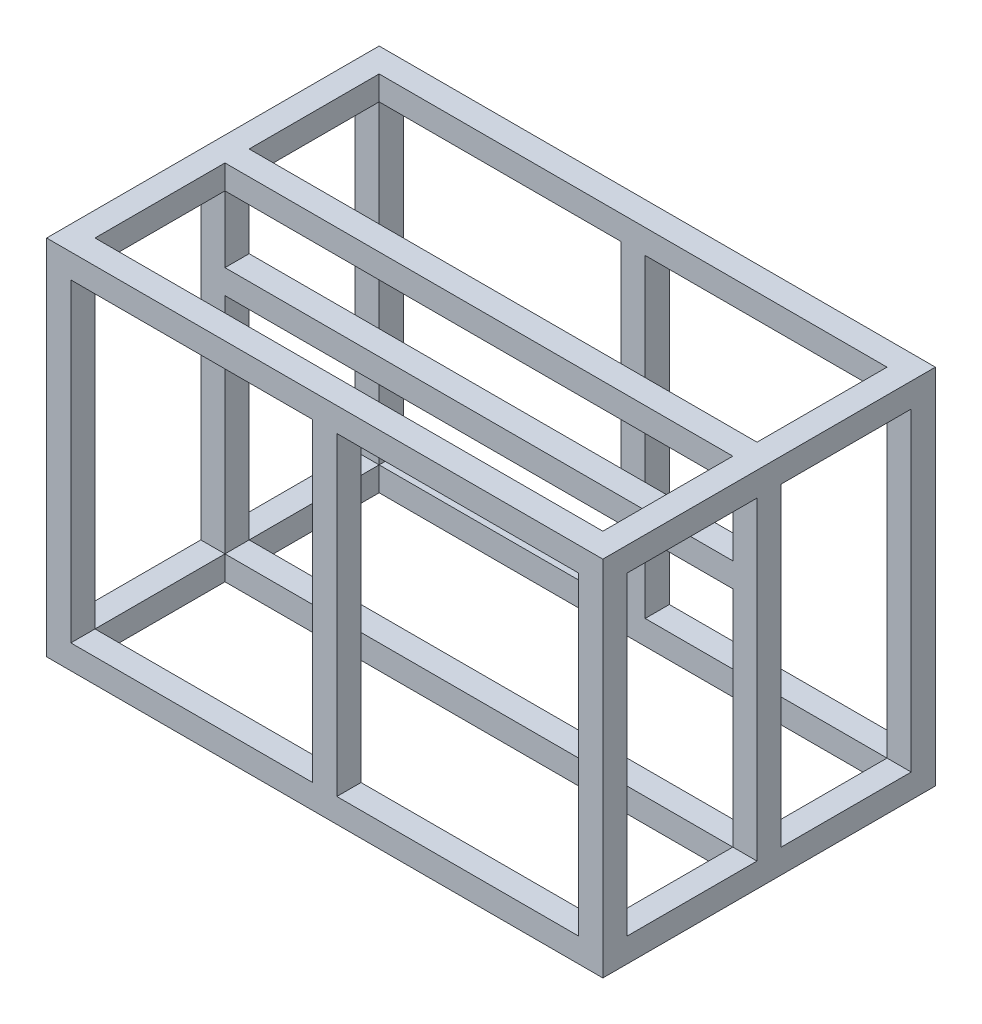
ISO-10303-21;
HEADER;
FILE_DESCRIPTION(('STEP AP214'),'2;1');
FILE_NAME('part.step','',(''),(''),'','','');
FILE_SCHEMA(('AUTOMOTIVE_DESIGN { 1 0 10303 214 1 1 1 1 }'));
ENDSEC;
DATA;
#1=APPLICATION_CONTEXT('core data for automotive mechanical design processes');
#2=APPLICATION_PROTOCOL_DEFINITION('international standard','automotive_design',2000,#1);
#3=PRODUCT_CONTEXT('',#1,'mechanical');
#4=PRODUCT('Part','Part','',(#3));
#5=PRODUCT_RELATED_PRODUCT_CATEGORY('part','',(#4));
#6=PRODUCT_DEFINITION_FORMATION('','',#4);
#7=PRODUCT_DEFINITION_CONTEXT('part definition',#1,'design');
#8=PRODUCT_DEFINITION('design','',#6,#7);
#9=PRODUCT_DEFINITION_SHAPE('','',#8);
#10=(LENGTH_UNIT() NAMED_UNIT(*) SI_UNIT(.MILLI.,.METRE.));
#11=(NAMED_UNIT(*) PLANE_ANGLE_UNIT() SI_UNIT($,.RADIAN.));
#12=(NAMED_UNIT(*) SI_UNIT($,.STERADIAN.) SOLID_ANGLE_UNIT());
#13=UNCERTAINTY_MEASURE_WITH_UNIT(LENGTH_MEASURE(1.E-05),#10,'distance_accuracy_value','');
#14=(GEOMETRIC_REPRESENTATION_CONTEXT(3) GLOBAL_UNCERTAINTY_ASSIGNED_CONTEXT((#13)) GLOBAL_UNIT_ASSIGNED_CONTEXT((#10,
#11,#12)) REPRESENTATION_CONTEXT('',''));
#15=CARTESIAN_POINT('',(0.,0.,0.));
#16=DIRECTION('',(0.,0.,1.));
#17=DIRECTION('',(1.,0.,0.));
#18=AXIS2_PLACEMENT_3D('',#15,#16,#17);
#19=CARTESIAN_POINT('',(40.,0.,295.));
#20=DIRECTION('',(0.,0.,-1.));
#21=DIRECTION('',(-1.,0.,0.));
#22=AXIS2_PLACEMENT_3D('',#19,#20,#21);
#23=PLANE('',#22);
#24=DIRECTION('',(0.,-1.,0.));
#25=VECTOR('',#24,1.);
#26=CARTESIAN_POINT('',(880.,450.,295.));
#27=LINE('',#26,#25);
#28=CARTESIAN_POINT('',(880.,560.,295.));
#29=VERTEX_POINT('',#28);
#30=CARTESIAN_POINT('',(880.,450.,295.));
#31=VERTEX_POINT('',#30);
#32=EDGE_CURVE('E12',#29,#31,#27,.T.);
#33=ORIENTED_EDGE('',*,*,#32,.T.);
#34=DIRECTION('',(-1.,0.,0.));
#35=VECTOR('',#34,1.);
#36=CARTESIAN_POINT('',(40.,450.,295.));
#37=LINE('',#36,#35);
#38=CARTESIAN_POINT('',(40.,450.,295.));
#39=VERTEX_POINT('',#38);
#40=EDGE_CURVE('E558',#31,#39,#37,.T.);
#41=ORIENTED_EDGE('',*,*,#40,.T.);
#42=DIRECTION('',(0.,1.,0.));
#43=VECTOR('',#42,1.);
#44=CARTESIAN_POINT('',(40.,450.,295.));
#45=LINE('',#44,#43);
#46=CARTESIAN_POINT('',(40.,560.,295.));
#47=VERTEX_POINT('',#46);
#48=EDGE_CURVE('E433',#39,#47,#45,.T.);
#49=ORIENTED_EDGE('',*,*,#48,.T.);
#50=DIRECTION('',(1.,0.,0.));
#51=VECTOR('',#50,1.);
#52=CARTESIAN_POINT('',(0.,560.,295.));
#53=LINE('',#52,#51);
#54=CARTESIAN_POINT('',(0.,560.,295.));
#55=VERTEX_POINT('',#54);
#56=EDGE_CURVE('E414',#55,#47,#53,.T.);
#57=ORIENTED_EDGE('',*,*,#56,.F.);
#58=DIRECTION('',(0.,1.,0.));
#59=VECTOR('',#58,1.);
#60=CARTESIAN_POINT('',(0.,40.0000000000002,295.));
#61=LINE('',#60,#59);
#62=CARTESIAN_POINT('',(0.,40.0000000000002,295.));
#63=VERTEX_POINT('',#62);
#64=EDGE_CURVE('E384',#63,#55,#61,.T.);
#65=ORIENTED_EDGE('',*,*,#64,.F.);
#66=DIRECTION('',(1.,0.,0.));
#67=VECTOR('',#66,1.);
#68=CARTESIAN_POINT('',(0.,40.0000000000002,295.));
#69=LINE('',#68,#67);
#70=CARTESIAN_POINT('',(40.,40.0000000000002,295.));
#71=VERTEX_POINT('',#70);
#72=EDGE_CURVE('E418',#63,#71,#69,.T.);
#73=ORIENTED_EDGE('',*,*,#72,.T.);
#74=CARTESIAN_POINT('',(40.,410.,295.));
#75=VERTEX_POINT('',#74);
#76=EDGE_CURVE('E435',#71,#75,#45,.T.);
#77=ORIENTED_EDGE('',*,*,#76,.T.);
#78=DIRECTION('',(1.,0.,0.));
#79=VECTOR('',#78,1.);
#80=CARTESIAN_POINT('',(40.,410.,295.));
#81=LINE('',#80,#79);
#82=CARTESIAN_POINT('',(880.,410.,295.));
#83=VERTEX_POINT('',#82);
#84=EDGE_CURVE('E556',#75,#83,#81,.T.);
#85=ORIENTED_EDGE('',*,*,#84,.T.);
#86=CARTESIAN_POINT('',(880.,40.0000000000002,295.));
#87=VERTEX_POINT('',#86);
#88=EDGE_CURVE('E37',#83,#87,#27,.T.);
#89=ORIENTED_EDGE('',*,*,#88,.T.);
#90=CARTESIAN_POINT('',(919.999999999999,40.0000000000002,295.));
#91=VERTEX_POINT('',#90);
#92=EDGE_CURVE('E394',#87,#91,#69,.T.);
#93=ORIENTED_EDGE('',*,*,#92,.T.);
#94=DIRECTION('',(0.,1.,0.));
#95=VECTOR('',#94,1.);
#96=CARTESIAN_POINT('',(919.999999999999,40.0000000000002,295.));
#97=LINE('',#96,#95);
#98=CARTESIAN_POINT('',(919.999999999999,560.,295.));
#99=VERTEX_POINT('',#98);
#100=EDGE_CURVE('E397',#91,#99,#97,.T.);
#101=ORIENTED_EDGE('',*,*,#100,.T.);
#102=EDGE_CURVE('E417',#29,#99,#53,.T.);
#103=ORIENTED_EDGE('',*,*,#102,.F.);
#104=EDGE_LOOP('',(#33,#41,#49,#57,#65,#73,#77,#85,#89,#93,#101,#103));
#105=FACE_BOUND('',#104,.T.);
#106=ADVANCED_FACE('F33',(#105),#23,.F.);
#107=CARTESIAN_POINT('',(40.,0.,255.));
#108=DIRECTION('',(0.,0.,1.));
#109=DIRECTION('',(1.,0.,0.));
#110=AXIS2_PLACEMENT_3D('',#107,#108,#109);
#111=PLANE('',#110);
#112=DIRECTION('',(1.,0.,0.));
#113=VECTOR('',#112,1.);
#114=CARTESIAN_POINT('',(40.,450.,255.));
#115=LINE('',#114,#113);
#116=CARTESIAN_POINT('',(40.,450.,255.));
#117=VERTEX_POINT('',#116);
#118=CARTESIAN_POINT('',(880.,450.,255.));
#119=VERTEX_POINT('',#118);
#120=EDGE_CURVE('E480',#117,#119,#115,.T.);
#121=ORIENTED_EDGE('',*,*,#120,.T.);
#122=DIRECTION('',(0.,1.,0.));
#123=VECTOR('',#122,1.);
#124=CARTESIAN_POINT('',(880.,450.,255.));
#125=LINE('',#124,#123);
#126=CARTESIAN_POINT('',(880.,560.,255.));
#127=VERTEX_POINT('',#126);
#128=EDGE_CURVE('E379',#119,#127,#125,.T.);
#129=ORIENTED_EDGE('',*,*,#128,.T.);
#130=DIRECTION('',(1.,0.,0.));
#131=VECTOR('',#130,1.);
#132=CARTESIAN_POINT('',(0.,560.,255.));
#133=LINE('',#132,#131);
#134=CARTESIAN_POINT('',(919.999999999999,560.,255.));
#135=VERTEX_POINT('',#134);
#136=EDGE_CURVE('E361',#127,#135,#133,.T.);
#137=ORIENTED_EDGE('',*,*,#136,.T.);
#138=DIRECTION('',(0.,-1.,0.));
#139=VECTOR('',#138,1.);
#140=CARTESIAN_POINT('',(919.999999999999,40.0000000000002,255.));
#141=LINE('',#140,#139);
#142=CARTESIAN_POINT('',(919.999999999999,40.0000000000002,255.));
#143=VERTEX_POINT('',#142);
#144=EDGE_CURVE('E340',#135,#143,#141,.T.);
#145=ORIENTED_EDGE('',*,*,#144,.T.);
#146=DIRECTION('',(1.,0.,0.));
#147=VECTOR('',#146,1.);
#148=CARTESIAN_POINT('',(0.,40.0000000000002,255.));
#149=LINE('',#148,#147);
#150=CARTESIAN_POINT('',(880.,40.0000000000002,255.));
#151=VERTEX_POINT('',#150);
#152=EDGE_CURVE('E357',#151,#143,#149,.T.);
#153=ORIENTED_EDGE('',*,*,#152,.F.);
#154=CARTESIAN_POINT('',(880.,410.,255.));
#155=VERTEX_POINT('',#154);
#156=EDGE_CURVE('E375',#151,#155,#125,.T.);
#157=ORIENTED_EDGE('',*,*,#156,.T.);
#158=DIRECTION('',(-1.,0.,0.));
#159=VECTOR('',#158,1.);
#160=CARTESIAN_POINT('',(40.,410.,255.));
#161=LINE('',#160,#159);
#162=CARTESIAN_POINT('',(40.,410.,255.));
#163=VERTEX_POINT('',#162);
#164=EDGE_CURVE('E477',#155,#163,#161,.T.);
#165=ORIENTED_EDGE('',*,*,#164,.T.);
#166=DIRECTION('',(0.,-1.,0.));
#167=VECTOR('',#166,1.);
#168=CARTESIAN_POINT('',(40.,450.,255.));
#169=LINE('',#168,#167);
#170=CARTESIAN_POINT('',(40.,40.0000000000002,255.));
#171=VERTEX_POINT('',#170);
#172=EDGE_CURVE('E374',#163,#171,#169,.T.);
#173=ORIENTED_EDGE('',*,*,#172,.T.);
#174=CARTESIAN_POINT('',(0.,40.0000000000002,255.));
#175=VERTEX_POINT('',#174);
#176=EDGE_CURVE('E354',#175,#171,#149,.T.);
#177=ORIENTED_EDGE('',*,*,#176,.F.);
#178=DIRECTION('',(0.,-1.,0.));
#179=VECTOR('',#178,1.);
#180=CARTESIAN_POINT('',(0.,40.0000000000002,255.));
#181=LINE('',#180,#179);
#182=CARTESIAN_POINT('',(0.,560.,255.));
#183=VERTEX_POINT('',#182);
#184=EDGE_CURVE('E339',#183,#175,#181,.T.);
#185=ORIENTED_EDGE('',*,*,#184,.F.);
#186=CARTESIAN_POINT('',(40.,560.,255.));
#187=VERTEX_POINT('',#186);
#188=EDGE_CURVE('E358',#183,#187,#133,.T.);
#189=ORIENTED_EDGE('',*,*,#188,.T.);
#190=EDGE_CURVE('E378',#187,#117,#169,.T.);
#191=ORIENTED_EDGE('',*,*,#190,.T.);
#192=EDGE_LOOP('',(#121,#129,#137,#145,#153,#157,#165,#173,#177,#185,#189,#191));
#193=FACE_BOUND('',#192,.T.);
#194=ADVANCED_FACE('F738',(#193),#111,.F.);
#195=DIRECTION('',(0.,1.,0.));
#196=VECTOR('',#195,1.);
#197=CARTESIAN_POINT('',(880.,0.,295.));
#198=LINE('',#197,#196);
#199=CARTESIAN_POINT('',(880.,0.,295.));
#200=VERTEX_POINT('',#199);
#201=EDGE_CURVE('E529',#200,#87,#198,.T.);
#202=ORIENTED_EDGE('',*,*,#201,.T.);
#203=DIRECTION('',(-1.,0.,0.));
#204=VECTOR('',#203,1.);
#205=CARTESIAN_POINT('',(40.,39.9999999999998,295.));
#206=LINE('',#205,#204);
#207=EDGE_CURVE('E553',#87,#71,#206,.T.);
#208=ORIENTED_EDGE('',*,*,#207,.T.);
#209=DIRECTION('',(0.,1.,0.));
#210=VECTOR('',#209,1.);
#211=CARTESIAN_POINT('',(40.,0.,295.));
#212=LINE('',#211,#210);
#213=CARTESIAN_POINT('',(40.,0.,295.));
#214=VERTEX_POINT('',#213);
#215=EDGE_CURVE('E524',#214,#71,#212,.T.);
#216=ORIENTED_EDGE('',*,*,#215,.F.);
#217=DIRECTION('',(-1.,0.,0.));
#218=VECTOR('',#217,1.);
#219=CARTESIAN_POINT('',(40.,0.,295.));
#220=LINE('',#219,#218);
#221=EDGE_CURVE('E511',#200,#214,#220,.T.);
#222=ORIENTED_EDGE('',*,*,#221,.F.);
#223=EDGE_LOOP('',(#202,#208,#216,#222));
#224=FACE_BOUND('',#223,.T.);
#225=ADVANCED_FACE('F704',(#224),#23,.F.);
#226=DIRECTION('',(1.,0.,0.));
#227=VECTOR('',#226,1.);
#228=CARTESIAN_POINT('',(40.,39.9999999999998,255.));
#229=LINE('',#228,#227);
#230=EDGE_CURVE('E463',#171,#151,#229,.T.);
#231=ORIENTED_EDGE('',*,*,#230,.T.);
#232=DIRECTION('',(0.,1.,0.));
#233=VECTOR('',#232,1.);
#234=CARTESIAN_POINT('',(880.,0.,255.));
#235=LINE('',#234,#233);
#236=CARTESIAN_POINT('',(880.,0.,255.));
#237=VERTEX_POINT('',#236);
#238=EDGE_CURVE('E469',#237,#151,#235,.T.);
#239=ORIENTED_EDGE('',*,*,#238,.F.);
#240=DIRECTION('',(1.,0.,0.));
#241=VECTOR('',#240,1.);
#242=CARTESIAN_POINT('',(40.,0.,255.));
#243=LINE('',#242,#241);
#244=CARTESIAN_POINT('',(40.,0.,255.));
#245=VERTEX_POINT('',#244);
#246=EDGE_CURVE('E439',#245,#237,#243,.T.);
#247=ORIENTED_EDGE('',*,*,#246,.F.);
#248=DIRECTION('',(0.,1.,0.));
#249=VECTOR('',#248,1.);
#250=CARTESIAN_POINT('',(40.,0.,255.));
#251=LINE('',#250,#249);
#252=EDGE_CURVE('E473',#245,#171,#251,.T.);
#253=ORIENTED_EDGE('',*,*,#252,.T.);
#254=EDGE_LOOP('',(#231,#239,#247,#253));
#255=FACE_BOUND('',#254,.T.);
#256=ADVANCED_FACE('F796',(#255),#111,.F.);
#257=CARTESIAN_POINT('',(40.,0.,40.));
#258=DIRECTION('',(0.,0.,-1.));
#259=DIRECTION('',(-1.,0.,0.));
#260=AXIS2_PLACEMENT_3D('',#257,#258,#259);
#261=PLANE('',#260);
#262=DIRECTION('',(0.,-1.,0.));
#263=VECTOR('',#262,1.);
#264=CARTESIAN_POINT('',(440.,450.,40.));
#265=LINE('',#264,#263);
#266=CARTESIAN_POINT('',(440.,560.,40.));
#267=VERTEX_POINT('',#266);
#268=CARTESIAN_POINT('',(440.,39.9999999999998,40.));
#269=VERTEX_POINT('',#268);
#270=EDGE_CURVE('E496',#267,#269,#265,.T.);
#271=ORIENTED_EDGE('',*,*,#270,.T.);
#272=DIRECTION('',(-1.,0.,0.));
#273=VECTOR('',#272,1.);
#274=CARTESIAN_POINT('',(40.,39.9999999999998,40.));
#275=LINE('',#274,#273);
#276=CARTESIAN_POINT('',(40.,40.0000000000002,40.));
#277=VERTEX_POINT('',#276);
#278=EDGE_CURVE('E488',#269,#277,#275,.T.);
#279=ORIENTED_EDGE('',*,*,#278,.T.);
#280=DIRECTION('',(0.,1.,0.));
#281=VECTOR('',#280,1.);
#282=CARTESIAN_POINT('',(40.,0.,40.));
#283=LINE('',#282,#281);
#284=CARTESIAN_POINT('',(40.,0.,40.));
#285=VERTEX_POINT('',#284);
#286=EDGE_CURVE('E460',#285,#277,#283,.T.);
#287=ORIENTED_EDGE('',*,*,#286,.F.);
#288=DIRECTION('',(-1.,0.,0.));
#289=VECTOR('',#288,1.);
#290=CARTESIAN_POINT('',(40.,0.,40.));
#291=LINE('',#290,#289);
#292=CARTESIAN_POINT('',(880.,0.,40.));
#293=VERTEX_POINT('',#292);
#294=EDGE_CURVE('E446',#293,#285,#291,.T.);
#295=ORIENTED_EDGE('',*,*,#294,.F.);
#296=DIRECTION('',(0.,1.,0.));
#297=VECTOR('',#296,1.);
#298=CARTESIAN_POINT('',(880.,0.,40.));
#299=LINE('',#298,#297);
#300=CARTESIAN_POINT('',(880.,40.0000000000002,40.));
#301=VERTEX_POINT('',#300);
#302=EDGE_CURVE('E465',#293,#301,#299,.T.);
#303=ORIENTED_EDGE('',*,*,#302,.T.);
#304=DIRECTION('',(-1.,0.,0.));
#305=VECTOR('',#304,1.);
#306=CARTESIAN_POINT('',(480.,39.9999999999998,40.));
#307=LINE('',#306,#305);
#308=CARTESIAN_POINT('',(480.,39.9999999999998,40.));
#309=VERTEX_POINT('',#308);
#310=EDGE_CURVE('E485',#301,#309,#307,.T.);
#311=ORIENTED_EDGE('',*,*,#310,.T.);
#312=DIRECTION('',(0.,1.,0.));
#313=VECTOR('',#312,1.);
#314=CARTESIAN_POINT('',(480.,450.,40.));
#315=LINE('',#314,#313);
#316=CARTESIAN_POINT('',(480.,560.,40.));
#317=VERTEX_POINT('',#316);
#318=EDGE_CURVE('E494',#309,#317,#315,.T.);
#319=ORIENTED_EDGE('',*,*,#318,.T.);
#320=DIRECTION('',(1.,0.,0.));
#321=VECTOR('',#320,1.);
#322=CARTESIAN_POINT('',(480.,560.,40.));
#323=LINE('',#322,#321);
#324=CARTESIAN_POINT('',(880.,560.,40.));
#325=VERTEX_POINT('',#324);
#326=EDGE_CURVE('E491',#317,#325,#323,.T.);
#327=ORIENTED_EDGE('',*,*,#326,.T.);
#328=CARTESIAN_POINT('',(880.,600.,40.));
#329=VERTEX_POINT('',#328);
#330=EDGE_CURVE('E468',#325,#329,#299,.T.);
#331=ORIENTED_EDGE('',*,*,#330,.T.);
#332=DIRECTION('',(-1.,0.,0.));
#333=VECTOR('',#332,1.);
#334=CARTESIAN_POINT('',(40.,600.,40.));
#335=LINE('',#334,#333);
#336=CARTESIAN_POINT('',(40.,600.,40.));
#337=VERTEX_POINT('',#336);
#338=EDGE_CURVE('E440',#329,#337,#335,.T.);
#339=ORIENTED_EDGE('',*,*,#338,.T.);
#340=CARTESIAN_POINT('',(40.,560.,40.));
#341=VERTEX_POINT('',#340);
#342=EDGE_CURVE('E464',#341,#337,#283,.T.);
#343=ORIENTED_EDGE('',*,*,#342,.F.);
#344=DIRECTION('',(1.,0.,0.));
#345=VECTOR('',#344,1.);
#346=CARTESIAN_POINT('',(40.,560.,40.));
#347=LINE('',#346,#345);
#348=EDGE_CURVE('E498',#341,#267,#347,.T.);
#349=ORIENTED_EDGE('',*,*,#348,.T.);
#350=EDGE_LOOP('',(#271,#279,#287,#295,#303,#311,#319,#327,#331,#339,#343,#349));
#351=FACE_BOUND('',#350,.T.);
#352=ADVANCED_FACE('F729',(#351),#261,.F.);
#353=DIRECTION('',(0.,-1.,0.));
#354=VECTOR('',#353,1.);
#355=CARTESIAN_POINT('',(880.,450.,40.));
#356=LINE('',#355,#354);
#357=EDGE_CURVE('E370',#325,#301,#356,.T.);
#358=ORIENTED_EDGE('',*,*,#357,.T.);
#359=DIRECTION('',(1.,0.,0.));
#360=VECTOR('',#359,1.);
#361=CARTESIAN_POINT('',(0.,40.0000000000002,40.));
#362=LINE('',#361,#360);
#363=CARTESIAN_POINT('',(919.999999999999,40.0000000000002,40.));
#364=VERTEX_POINT('',#363);
#365=EDGE_CURVE('E328',#301,#364,#362,.T.);
#366=ORIENTED_EDGE('',*,*,#365,.T.);
#367=DIRECTION('',(0.,1.,0.));
#368=VECTOR('',#367,1.);
#369=CARTESIAN_POINT('',(919.999999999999,40.0000000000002,40.));
#370=LINE('',#369,#368);
#371=CARTESIAN_POINT('',(919.999999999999,560.,40.));
#372=VERTEX_POINT('',#371);
#373=EDGE_CURVE('E349',#364,#372,#370,.T.);
#374=ORIENTED_EDGE('',*,*,#373,.T.);
#375=DIRECTION('',(1.,0.,0.));
#376=VECTOR('',#375,1.);
#377=CARTESIAN_POINT('',(0.,560.,40.));
#378=LINE('',#377,#376);
#379=EDGE_CURVE('E327',#325,#372,#378,.T.);
#380=ORIENTED_EDGE('',*,*,#379,.F.);
#381=EDGE_LOOP('',(#358,#366,#374,#380));
#382=FACE_BOUND('',#381,.T.);
#383=ADVANCED_FACE('F749',(#382),#261,.F.);
#384=CARTESIAN_POINT('',(40.,0.,510.));
#385=DIRECTION('',(0.,0.,1.));
#386=DIRECTION('',(1.,0.,0.));
#387=AXIS2_PLACEMENT_3D('',#384,#385,#386);
#388=PLANE('',#387);
#389=DIRECTION('',(-1.,0.,0.));
#390=VECTOR('',#389,1.);
#391=CARTESIAN_POINT('',(480.,560.,510.));
#392=LINE('',#391,#390);
#393=CARTESIAN_POINT('',(880.,560.,510.));
#394=VERTEX_POINT('',#393);
#395=CARTESIAN_POINT('',(480.,560.,510.));
#396=VERTEX_POINT('',#395);
#397=EDGE_CURVE('E545',#394,#396,#392,.T.);
#398=ORIENTED_EDGE('',*,*,#397,.T.);
#399=DIRECTION('',(0.,-1.,0.));
#400=VECTOR('',#399,1.);
#401=CARTESIAN_POINT('',(480.,39.9999999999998,510.));
#402=LINE('',#401,#400);
#403=CARTESIAN_POINT('',(480.,39.9999999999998,510.));
#404=VERTEX_POINT('',#403);
#405=EDGE_CURVE('E681',#396,#404,#402,.T.);
#406=ORIENTED_EDGE('',*,*,#405,.T.);
#407=DIRECTION('',(1.,0.,0.));
#408=VECTOR('',#407,1.);
#409=CARTESIAN_POINT('',(480.,39.9999999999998,510.));
#410=LINE('',#409,#408);
#411=CARTESIAN_POINT('',(880.,40.0000000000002,510.));
#412=VERTEX_POINT('',#411);
#413=EDGE_CURVE('E527',#404,#412,#410,.T.);
#414=ORIENTED_EDGE('',*,*,#413,.T.);
#415=DIRECTION('',(0.,1.,0.));
#416=VECTOR('',#415,1.);
#417=CARTESIAN_POINT('',(880.,0.,510.));
#418=LINE('',#417,#416);
#419=CARTESIAN_POINT('',(880.,0.,510.));
#420=VERTEX_POINT('',#419);
#421=EDGE_CURVE('E533',#420,#412,#418,.T.);
#422=ORIENTED_EDGE('',*,*,#421,.F.);
#423=DIRECTION('',(1.,0.,0.));
#424=VECTOR('',#423,1.);
#425=CARTESIAN_POINT('',(40.,0.,510.));
#426=LINE('',#425,#424);
#427=CARTESIAN_POINT('',(40.,0.,510.));
#428=VERTEX_POINT('',#427);
#429=EDGE_CURVE('E504',#428,#420,#426,.T.);
#430=ORIENTED_EDGE('',*,*,#429,.F.);
#431=DIRECTION('',(0.,1.,0.));
#432=VECTOR('',#431,1.);
#433=CARTESIAN_POINT('',(40.,0.,510.));
#434=LINE('',#433,#432);
#435=CARTESIAN_POINT('',(40.,40.0000000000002,510.));
#436=VERTEX_POINT('',#435);
#437=EDGE_CURVE('E537',#428,#436,#434,.T.);
#438=ORIENTED_EDGE('',*,*,#437,.T.);
#439=DIRECTION('',(1.,0.,0.));
#440=VECTOR('',#439,1.);
#441=CARTESIAN_POINT('',(40.,39.9999999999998,510.));
#442=LINE('',#441,#440);
#443=CARTESIAN_POINT('',(440.,39.9999999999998,510.));
#444=VERTEX_POINT('',#443);
#445=EDGE_CURVE('E542',#436,#444,#442,.T.);
#446=ORIENTED_EDGE('',*,*,#445,.T.);
#447=DIRECTION('',(0.,1.,0.));
#448=VECTOR('',#447,1.);
#449=CARTESIAN_POINT('',(440.,450.,510.));
#450=LINE('',#449,#448);
#451=CARTESIAN_POINT('',(440.,560.,510.));
#452=VERTEX_POINT('',#451);
#453=EDGE_CURVE('E548',#444,#452,#450,.T.);
#454=ORIENTED_EDGE('',*,*,#453,.T.);
#455=DIRECTION('',(-1.,0.,0.));
#456=VECTOR('',#455,1.);
#457=CARTESIAN_POINT('',(40.,560.,510.));
#458=LINE('',#457,#456);
#459=CARTESIAN_POINT('',(40.,560.,510.));
#460=VERTEX_POINT('',#459);
#461=EDGE_CURVE('E550',#452,#460,#458,.T.);
#462=ORIENTED_EDGE('',*,*,#461,.T.);
#463=CARTESIAN_POINT('',(40.,600.,510.));
#464=VERTEX_POINT('',#463);
#465=EDGE_CURVE('E514',#460,#464,#434,.T.);
#466=ORIENTED_EDGE('',*,*,#465,.T.);
#467=DIRECTION('',(1.,0.,0.));
#468=VECTOR('',#467,1.);
#469=CARTESIAN_POINT('',(40.,600.,510.));
#470=LINE('',#469,#468);
#471=CARTESIAN_POINT('',(880.,600.,510.));
#472=VERTEX_POINT('',#471);
#473=EDGE_CURVE('E516',#464,#472,#470,.T.);
#474=ORIENTED_EDGE('',*,*,#473,.T.);
#475=EDGE_CURVE('E536',#394,#472,#418,.T.);
#476=ORIENTED_EDGE('',*,*,#475,.F.);
#477=EDGE_LOOP('',(#398,#406,#414,#422,#430,#438,#446,#454,#462,#466,#474,#476));
#478=FACE_BOUND('',#477,.T.);
#479=ADVANCED_FACE('F809',(#478),#388,.F.);
#480=DIRECTION('',(0.,-1.,0.));
#481=VECTOR('',#480,1.);
#482=CARTESIAN_POINT('',(40.,450.,510.));
#483=LINE('',#482,#481);
#484=EDGE_CURVE('E431',#460,#436,#483,.T.);
#485=ORIENTED_EDGE('',*,*,#484,.T.);
#486=DIRECTION('',(1.,0.,0.));
#487=VECTOR('',#486,1.);
#488=CARTESIAN_POINT('',(0.,40.0000000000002,510.));
#489=LINE('',#488,#487);
#490=CARTESIAN_POINT('',(0.,40.0000000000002,510.));
#491=VERTEX_POINT('',#490);
#492=EDGE_CURVE('E405',#491,#436,#489,.T.);
#493=ORIENTED_EDGE('',*,*,#492,.F.);
#494=DIRECTION('',(0.,-1.,0.));
#495=VECTOR('',#494,1.);
#496=CARTESIAN_POINT('',(0.,40.0000000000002,510.));
#497=LINE('',#496,#495);
#498=CARTESIAN_POINT('',(0.,560.,510.));
#499=VERTEX_POINT('',#498);
#500=EDGE_CURVE('E391',#499,#491,#497,.T.);
#501=ORIENTED_EDGE('',*,*,#500,.F.);
#502=DIRECTION('',(1.,0.,0.));
#503=VECTOR('',#502,1.);
#504=CARTESIAN_POINT('',(0.,560.,510.));
#505=LINE('',#504,#503);
#506=EDGE_CURVE('E410',#499,#460,#505,.T.);
#507=ORIENTED_EDGE('',*,*,#506,.T.);
#508=EDGE_LOOP('',(#485,#493,#501,#507));
#509=FACE_BOUND('',#508,.T.);
#510=ADVANCED_FACE('F810',(#509),#388,.F.);
#511=CARTESIAN_POINT('',(40.,450.,550.));
#512=DIRECTION('',(1.,0.,0.));
#513=DIRECTION('',(0.,0.,-1.));
#514=AXIS2_PLACEMENT_3D('',#511,#512,#513);
#515=PLANE('',#514);
#516=ORIENTED_EDGE('',*,*,#172,.F.);
#517=DIRECTION('',(0.,0.,-1.));
#518=VECTOR('',#517,1.);
#519=CARTESIAN_POINT('',(40.,410.,550.));
#520=LINE('',#519,#518);
#521=EDGE_CURVE('E595',#75,#163,#520,.T.);
#522=ORIENTED_EDGE('',*,*,#521,.F.);
#523=ORIENTED_EDGE('',*,*,#76,.F.);
#524=DIRECTION('',(0.,0.,-1.));
#525=VECTOR('',#524,1.);
#526=CARTESIAN_POINT('',(40.,39.9999999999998,550.));
#527=LINE('',#526,#525);
#528=EDGE_CURVE('E596',#71,#171,#527,.T.);
#529=ORIENTED_EDGE('',*,*,#528,.T.);
#530=EDGE_LOOP('',(#516,#522,#523,#529));
#531=FACE_BOUND('',#530,.T.);
#532=ADVANCED_FACE('F920',(#531),#515,.T.);
#533=DIRECTION('',(0.,0.,-1.));
#534=VECTOR('',#533,1.);
#535=CARTESIAN_POINT('',(40.,40.0000000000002,550.));
#536=LINE('',#535,#534);
#537=EDGE_CURVE('E324',#171,#277,#536,.T.);
#538=ORIENTED_EDGE('',*,*,#537,.F.);
#539=ORIENTED_EDGE('',*,*,#252,.F.);
#540=DIRECTION('',(0.,0.,1.));
#541=VECTOR('',#540,1.);
#542=CARTESIAN_POINT('',(40.,0.,255.));
#543=LINE('',#542,#541);
#544=EDGE_CURVE('E436',#285,#245,#543,.T.);
#545=ORIENTED_EDGE('',*,*,#544,.F.);
#546=ORIENTED_EDGE('',*,*,#286,.T.);
#547=EDGE_LOOP('',(#538,#539,#545,#546));
#548=FACE_BOUND('',#547,.T.);
#549=ADVANCED_FACE('F926',(#548),#515,.T.);
#550=ORIENTED_EDGE('',*,*,#190,.F.);
#551=DIRECTION('',(0.,0.,-1.));
#552=VECTOR('',#551,1.);
#553=CARTESIAN_POINT('',(40.,560.,550.));
#554=LINE('',#553,#552);
#555=EDGE_CURVE('E648',#47,#187,#554,.T.);
#556=ORIENTED_EDGE('',*,*,#555,.F.);
#557=ORIENTED_EDGE('',*,*,#48,.F.);
#558=DIRECTION('',(0.,0.,-1.));
#559=VECTOR('',#558,1.);
#560=CARTESIAN_POINT('',(40.,450.,550.));
#561=LINE('',#560,#559);
#562=EDGE_CURVE('E634',#39,#117,#561,.T.);
#563=ORIENTED_EDGE('',*,*,#562,.T.);
#564=EDGE_LOOP('',(#550,#556,#557,#563));
#565=FACE_BOUND('',#564,.T.);
#566=ADVANCED_FACE('F1412',(#565),#515,.T.);
#567=DIRECTION('',(0.,0.,1.));
#568=VECTOR('',#567,1.);
#569=CARTESIAN_POINT('',(40.,560.,550.));
#570=LINE('',#569,#568);
#571=EDGE_CURVE('E364',#341,#187,#570,.T.);
#572=ORIENTED_EDGE('',*,*,#571,.F.);
#573=ORIENTED_EDGE('',*,*,#342,.T.);
#574=DIRECTION('',(0.,0.,1.));
#575=VECTOR('',#574,1.);
#576=CARTESIAN_POINT('',(40.,600.,255.));
#577=LINE('',#576,#575);
#578=CARTESIAN_POINT('',(40.,600.,255.));
#579=VERTEX_POINT('',#578);
#580=EDGE_CURVE('E450',#337,#579,#577,.T.);
#581=ORIENTED_EDGE('',*,*,#580,.T.);
#582=EDGE_CURVE('E449',#187,#579,#251,.T.);
#583=ORIENTED_EDGE('',*,*,#582,.F.);
#584=EDGE_LOOP('',(#572,#573,#581,#583));
#585=FACE_BOUND('',#584,.T.);
#586=ADVANCED_FACE('F1366',(#585),#515,.T.);
#587=CARTESIAN_POINT('',(880.,450.,550.));
#588=DIRECTION('',(-1.,0.,0.));
#589=DIRECTION('',(0.,0.,1.));
#590=AXIS2_PLACEMENT_3D('',#587,#588,#589);
#591=PLANE('',#590);
#592=ORIENTED_EDGE('',*,*,#128,.F.);
#593=DIRECTION('',(0.,0.,-1.));
#594=VECTOR('',#593,1.);
#595=CARTESIAN_POINT('',(880.,450.,550.));
#596=LINE('',#595,#594);
#597=EDGE_CURVE('E622',#31,#119,#596,.T.);
#598=ORIENTED_EDGE('',*,*,#597,.F.);
#599=ORIENTED_EDGE('',*,*,#32,.F.);
#600=DIRECTION('',(0.,0.,-1.));
#601=VECTOR('',#600,1.);
#602=CARTESIAN_POINT('',(880.,560.,550.));
#603=LINE('',#602,#601);
#604=EDGE_CURVE('E623',#29,#127,#603,.T.);
#605=ORIENTED_EDGE('',*,*,#604,.T.);
#606=EDGE_LOOP('',(#592,#598,#599,#605));
#607=FACE_BOUND('',#606,.T.);
#608=ADVANCED_FACE('F766',(#607),#591,.T.);
#609=DIRECTION('',(0.,0.,-1.));
#610=VECTOR('',#609,1.);
#611=CARTESIAN_POINT('',(880.,560.,550.));
#612=LINE('',#611,#610);
#613=EDGE_CURVE('E356',#127,#325,#612,.T.);
#614=ORIENTED_EDGE('',*,*,#613,.F.);
#615=CARTESIAN_POINT('',(880.,600.,255.));
#616=VERTEX_POINT('',#615);
#617=EDGE_CURVE('E472',#127,#616,#235,.T.);
#618=ORIENTED_EDGE('',*,*,#617,.T.);
#619=DIRECTION('',(0.,0.,-1.));
#620=VECTOR('',#619,1.);
#621=CARTESIAN_POINT('',(880.,600.,255.));
#622=LINE('',#621,#620);
#623=EDGE_CURVE('E455',#616,#329,#622,.T.);
#624=ORIENTED_EDGE('',*,*,#623,.T.);
#625=ORIENTED_EDGE('',*,*,#330,.F.);
#626=EDGE_LOOP('',(#614,#618,#624,#625));
#627=FACE_BOUND('',#626,.T.);
#628=ADVANCED_FACE('F756',(#627),#591,.T.);
#629=ORIENTED_EDGE('',*,*,#156,.F.);
#630=DIRECTION('',(0.,0.,-1.));
#631=VECTOR('',#630,1.);
#632=CARTESIAN_POINT('',(880.,39.9999999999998,550.));
#633=LINE('',#632,#631);
#634=EDGE_CURVE('E581',#87,#151,#633,.T.);
#635=ORIENTED_EDGE('',*,*,#634,.F.);
#636=ORIENTED_EDGE('',*,*,#88,.F.);
#637=DIRECTION('',(0.,0.,-1.));
#638=VECTOR('',#637,1.);
#639=CARTESIAN_POINT('',(880.,410.,550.));
#640=LINE('',#639,#638);
#641=EDGE_CURVE('E573',#83,#155,#640,.T.);
#642=ORIENTED_EDGE('',*,*,#641,.T.);
#643=EDGE_LOOP('',(#629,#635,#636,#642));
#644=FACE_BOUND('',#643,.T.);
#645=ADVANCED_FACE('F707',(#644),#591,.T.);
#646=DIRECTION('',(0.,0.,1.));
#647=VECTOR('',#646,1.);
#648=CARTESIAN_POINT('',(880.,40.0000000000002,550.));
#649=LINE('',#648,#647);
#650=EDGE_CURVE('E366',#301,#151,#649,.T.);
#651=ORIENTED_EDGE('',*,*,#650,.F.);
#652=ORIENTED_EDGE('',*,*,#302,.F.);
#653=DIRECTION('',(0.,0.,-1.));
#654=VECTOR('',#653,1.);
#655=CARTESIAN_POINT('',(880.,0.,255.));
#656=LINE('',#655,#654);
#657=EDGE_CURVE('E443',#237,#293,#656,.T.);
#658=ORIENTED_EDGE('',*,*,#657,.F.);
#659=ORIENTED_EDGE('',*,*,#238,.T.);
#660=EDGE_LOOP('',(#651,#652,#658,#659));
#661=FACE_BOUND('',#660,.T.);
#662=ADVANCED_FACE('F733',(#661),#591,.T.);
#663=DIRECTION('',(0.,0.,-1.));
#664=VECTOR('',#663,1.);
#665=CARTESIAN_POINT('',(40.,40.0000000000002,550.));
#666=LINE('',#665,#664);
#667=EDGE_CURVE('E427',#436,#71,#666,.T.);
#668=ORIENTED_EDGE('',*,*,#667,.F.);
#669=ORIENTED_EDGE('',*,*,#437,.F.);
#670=DIRECTION('',(0.,0.,1.));
#671=VECTOR('',#670,1.);
#672=CARTESIAN_POINT('',(40.,0.,510.));
#673=LINE('',#672,#671);
#674=EDGE_CURVE('E501',#214,#428,#673,.T.);
#675=ORIENTED_EDGE('',*,*,#674,.F.);
#676=ORIENTED_EDGE('',*,*,#215,.T.);
#677=EDGE_LOOP('',(#668,#669,#675,#676));
#678=FACE_BOUND('',#677,.T.);
#679=ADVANCED_FACE('F880',(#678),#515,.T.);
#680=CARTESIAN_POINT('',(40.,560.,0.));
#681=VERTEX_POINT('',#680);
#682=EDGE_CURVE('E643',#341,#681,#554,.T.);
#683=ORIENTED_EDGE('',*,*,#682,.F.);
#684=DIRECTION('',(0.,1.,0.));
#685=VECTOR('',#684,1.);
#686=CARTESIAN_POINT('',(40.,450.,40.));
#687=LINE('',#686,#685);
#688=EDGE_CURVE('E372',#277,#341,#687,.T.);
#689=ORIENTED_EDGE('',*,*,#688,.F.);
#690=CARTESIAN_POINT('',(40.,39.9999999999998,0.));
#691=VERTEX_POINT('',#690);
#692=EDGE_CURVE('E591',#277,#691,#527,.T.);
#693=ORIENTED_EDGE('',*,*,#692,.T.);
#694=DIRECTION('',(0.,-1.,0.));
#695=VECTOR('',#694,1.);
#696=CARTESIAN_POINT('',(40.,450.,0.));
#697=LINE('',#696,#695);
#698=EDGE_CURVE('E630',#681,#691,#697,.T.);
#699=ORIENTED_EDGE('',*,*,#698,.F.);
#700=EDGE_LOOP('',(#683,#689,#693,#699));
#701=FACE_BOUND('',#700,.T.);
#702=ADVANCED_FACE('F916',(#701),#515,.T.);
#703=ORIENTED_EDGE('',*,*,#484,.F.);
#704=CARTESIAN_POINT('',(40.,560.,550.));
#705=VERTEX_POINT('',#704);
#706=EDGE_CURVE('E644',#705,#460,#554,.T.);
#707=ORIENTED_EDGE('',*,*,#706,.F.);
#708=DIRECTION('',(0.,-1.,0.));
#709=VECTOR('',#708,1.);
#710=CARTESIAN_POINT('',(40.,450.,550.));
#711=LINE('',#710,#709);
#712=CARTESIAN_POINT('',(40.,39.9999999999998,550.));
#713=VERTEX_POINT('',#712);
#714=EDGE_CURVE('E632',#705,#713,#711,.T.);
#715=ORIENTED_EDGE('',*,*,#714,.T.);
#716=EDGE_CURVE('E592',#713,#436,#527,.T.);
#717=ORIENTED_EDGE('',*,*,#716,.T.);
#718=EDGE_LOOP('',(#703,#707,#715,#717));
#719=FACE_BOUND('',#718,.T.);
#720=ADVANCED_FACE('F871',(#719),#515,.T.);
#721=DIRECTION('',(0.,0.,-1.));
#722=VECTOR('',#721,1.);
#723=CARTESIAN_POINT('',(880.,560.,550.));
#724=LINE('',#723,#722);
#725=EDGE_CURVE('E408',#394,#29,#724,.T.);
#726=ORIENTED_EDGE('',*,*,#725,.F.);
#727=ORIENTED_EDGE('',*,*,#475,.T.);
#728=DIRECTION('',(0.,0.,-1.));
#729=VECTOR('',#728,1.);
#730=CARTESIAN_POINT('',(880.,600.,510.));
#731=LINE('',#730,#729);
#732=CARTESIAN_POINT('',(880.,600.,295.));
#733=VERTEX_POINT('',#732);
#734=EDGE_CURVE('E519',#472,#733,#731,.T.);
#735=ORIENTED_EDGE('',*,*,#734,.T.);
#736=EDGE_CURVE('E532',#29,#733,#198,.T.);
#737=ORIENTED_EDGE('',*,*,#736,.F.);
#738=EDGE_LOOP('',(#726,#727,#735,#737));
#739=FACE_BOUND('',#738,.T.);
#740=ADVANCED_FACE('F847',(#739),#591,.T.);
#741=CARTESIAN_POINT('',(880.,39.9999999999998,0.));
#742=VERTEX_POINT('',#741);
#743=EDGE_CURVE('E576',#301,#742,#633,.T.);
#744=ORIENTED_EDGE('',*,*,#743,.F.);
#745=ORIENTED_EDGE('',*,*,#357,.F.);
#746=CARTESIAN_POINT('',(880.,560.,0.));
#747=VERTEX_POINT('',#746);
#748=EDGE_CURVE('E618',#325,#747,#603,.T.);
#749=ORIENTED_EDGE('',*,*,#748,.T.);
#750=DIRECTION('',(0.,1.,0.));
#751=VECTOR('',#750,1.);
#752=CARTESIAN_POINT('',(880.,450.,0.));
#753=LINE('',#752,#751);
#754=EDGE_CURVE('E610',#742,#747,#753,.T.);
#755=ORIENTED_EDGE('',*,*,#754,.F.);
#756=EDGE_LOOP('',(#744,#745,#749,#755));
#757=FACE_BOUND('',#756,.T.);
#758=ADVANCED_FACE('F750',(#757),#591,.T.);
#759=DIRECTION('',(0.,1.,0.));
#760=VECTOR('',#759,1.);
#761=CARTESIAN_POINT('',(880.,450.,510.));
#762=LINE('',#761,#760);
#763=EDGE_CURVE('E429',#412,#394,#762,.T.);
#764=ORIENTED_EDGE('',*,*,#763,.F.);
#765=CARTESIAN_POINT('',(880.,39.9999999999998,550.));
#766=VERTEX_POINT('',#765);
#767=EDGE_CURVE('E577',#766,#412,#633,.T.);
#768=ORIENTED_EDGE('',*,*,#767,.F.);
#769=DIRECTION('',(0.,1.,0.));
#770=VECTOR('',#769,1.);
#771=CARTESIAN_POINT('',(880.,450.,550.));
#772=LINE('',#771,#770);
#773=CARTESIAN_POINT('',(880.,560.,550.));
#774=VERTEX_POINT('',#773);
#775=EDGE_CURVE('E602',#766,#774,#772,.T.);
#776=ORIENTED_EDGE('',*,*,#775,.T.);
#777=EDGE_CURVE('E619',#774,#394,#603,.T.);
#778=ORIENTED_EDGE('',*,*,#777,.T.);
#779=EDGE_LOOP('',(#764,#768,#776,#778));
#780=FACE_BOUND('',#779,.T.);
#781=ADVANCED_FACE('F829',(#780),#591,.T.);
#782=CARTESIAN_POINT('',(40.,560.,550.));
#783=DIRECTION('',(0.,-1.,0.));
#784=DIRECTION('',(1.,0.,0.));
#785=AXIS2_PLACEMENT_3D('',#782,#783,#784);
#786=PLANE('',#785);
#787=ORIENTED_EDGE('',*,*,#348,.F.);
#788=ORIENTED_EDGE('',*,*,#682,.T.);
#789=DIRECTION('',(-1.,0.,0.));
#790=VECTOR('',#789,1.);
#791=CARTESIAN_POINT('',(40.,560.,0.));
#792=LINE('',#791,#790);
#793=CARTESIAN_POINT('',(440.,560.,0.));
#794=VERTEX_POINT('',#793);
#795=EDGE_CURVE('E637',#794,#681,#792,.T.);
#796=ORIENTED_EDGE('',*,*,#795,.F.);
#797=DIRECTION('',(0.,0.,-1.));
#798=VECTOR('',#797,1.);
#799=CARTESIAN_POINT('',(440.,560.,550.));
#800=LINE('',#799,#798);
#801=EDGE_CURVE('E647',#267,#794,#800,.T.);
#802=ORIENTED_EDGE('',*,*,#801,.F.);
#803=EDGE_LOOP('',(#787,#788,#796,#802));
#804=FACE_BOUND('',#803,.T.);
#805=ADVANCED_FACE('F901',(#804),#786,.T.);
#806=CARTESIAN_POINT('',(480.,560.,550.));
#807=DIRECTION('',(0.,-1.,0.));
#808=DIRECTION('',(1.,0.,0.));
#809=AXIS2_PLACEMENT_3D('',#806,#807,#808);
#810=PLANE('',#809);
#811=ORIENTED_EDGE('',*,*,#326,.F.);
#812=DIRECTION('',(0.,0.,-1.));
#813=VECTOR('',#812,1.);
#814=CARTESIAN_POINT('',(480.,560.,550.));
#815=LINE('',#814,#813);
#816=CARTESIAN_POINT('',(480.,560.,0.));
#817=VERTEX_POINT('',#816);
#818=EDGE_CURVE('E608',#317,#817,#815,.T.);
#819=ORIENTED_EDGE('',*,*,#818,.T.);
#820=DIRECTION('',(-1.,0.,0.));
#821=VECTOR('',#820,1.);
#822=CARTESIAN_POINT('',(480.,560.,0.));
#823=LINE('',#822,#821);
#824=EDGE_CURVE('E603',#747,#817,#823,.T.);
#825=ORIENTED_EDGE('',*,*,#824,.F.);
#826=ORIENTED_EDGE('',*,*,#748,.F.);
#827=EDGE_LOOP('',(#811,#819,#825,#826));
#828=FACE_BOUND('',#827,.T.);
#829=ADVANCED_FACE('F760',(#828),#810,.T.);
#830=CARTESIAN_POINT('',(40.,39.9999999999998,550.));
#831=DIRECTION('',(0.,1.,0.));
#832=DIRECTION('',(0.,0.,1.));
#833=AXIS2_PLACEMENT_3D('',#830,#831,#832);
#834=PLANE('',#833);
#835=ORIENTED_EDGE('',*,*,#278,.F.);
#836=DIRECTION('',(0.,0.,-1.));
#837=VECTOR('',#836,1.);
#838=CARTESIAN_POINT('',(440.,39.9999999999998,550.));
#839=LINE('',#838,#837);
#840=CARTESIAN_POINT('',(440.,39.9999999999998,0.));
#841=VERTEX_POINT('',#840);
#842=EDGE_CURVE('E585',#269,#841,#839,.T.);
#843=ORIENTED_EDGE('',*,*,#842,.T.);
#844=DIRECTION('',(1.,0.,0.));
#845=VECTOR('',#844,1.);
#846=CARTESIAN_POINT('',(40.,39.9999999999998,0.));
#847=LINE('',#846,#845);
#848=EDGE_CURVE('E580',#691,#841,#847,.T.);
#849=ORIENTED_EDGE('',*,*,#848,.F.);
#850=ORIENTED_EDGE('',*,*,#692,.F.);
#851=EDGE_LOOP('',(#835,#843,#849,#850));
#852=FACE_BOUND('',#851,.T.);
#853=ADVANCED_FACE('F887',(#852),#834,.T.);
#854=CARTESIAN_POINT('',(440.,39.9999999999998,550.));
#855=DIRECTION('',(-1.,0.,0.));
#856=DIRECTION('',(0.,0.,1.));
#857=AXIS2_PLACEMENT_3D('',#854,#855,#856);
#858=PLANE('',#857);
#859=ORIENTED_EDGE('',*,*,#842,.F.);
#860=ORIENTED_EDGE('',*,*,#270,.F.);
#861=ORIENTED_EDGE('',*,*,#801,.T.);
#862=DIRECTION('',(0.,1.,0.));
#863=VECTOR('',#862,1.);
#864=CARTESIAN_POINT('',(440.,450.,0.));
#865=LINE('',#864,#863);
#866=EDGE_CURVE('E626',#841,#794,#865,.T.);
#867=ORIENTED_EDGE('',*,*,#866,.F.);
#868=EDGE_LOOP('',(#859,#860,#861,#867));
#869=FACE_BOUND('',#868,.T.);
#870=ADVANCED_FACE('F894',(#869),#858,.T.);
#871=CARTESIAN_POINT('',(480.,39.9999999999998,550.));
#872=DIRECTION('',(0.,1.,0.));
#873=DIRECTION('',(0.,0.,1.));
#874=AXIS2_PLACEMENT_3D('',#871,#872,#873);
#875=PLANE('',#874);
#876=ORIENTED_EDGE('',*,*,#310,.F.);
#877=ORIENTED_EDGE('',*,*,#743,.T.);
#878=DIRECTION('',(1.,0.,0.));
#879=VECTOR('',#878,1.);
#880=CARTESIAN_POINT('',(480.,39.9999999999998,0.));
#881=LINE('',#880,#879);
#882=CARTESIAN_POINT('',(480.,39.9999999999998,0.));
#883=VERTEX_POINT('',#882);
#884=EDGE_CURVE('E563',#883,#742,#881,.T.);
#885=ORIENTED_EDGE('',*,*,#884,.F.);
#886=DIRECTION('',(0.,0.,-1.));
#887=VECTOR('',#886,1.);
#888=CARTESIAN_POINT('',(480.,39.9999999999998,550.));
#889=LINE('',#888,#887);
#890=EDGE_CURVE('E567',#309,#883,#889,.T.);
#891=ORIENTED_EDGE('',*,*,#890,.F.);
#892=EDGE_LOOP('',(#876,#877,#885,#891));
#893=FACE_BOUND('',#892,.T.);
#894=ADVANCED_FACE('F715',(#893),#875,.T.);
#895=CARTESIAN_POINT('',(480.,39.9999999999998,550.));
#896=DIRECTION('',(1.,0.,0.));
#897=DIRECTION('',(0.,0.,-1.));
#898=AXIS2_PLACEMENT_3D('',#895,#896,#897);
#899=PLANE('',#898);
#900=ORIENTED_EDGE('',*,*,#318,.F.);
#901=ORIENTED_EDGE('',*,*,#890,.T.);
#902=DIRECTION('',(0.,-1.,0.));
#903=VECTOR('',#902,1.);
#904=CARTESIAN_POINT('',(480.,450.,0.));
#905=LINE('',#904,#903);
#906=EDGE_CURVE('E599',#817,#883,#905,.T.);
#907=ORIENTED_EDGE('',*,*,#906,.F.);
#908=ORIENTED_EDGE('',*,*,#818,.F.);
#909=EDGE_LOOP('',(#900,#901,#907,#908));
#910=FACE_BOUND('',#909,.T.);
#911=ADVANCED_FACE('F726',(#910),#899,.T.);
#912=CARTESIAN_POINT('',(480.,450.,550.));
#913=DIRECTION('',(0.,1.,0.));
#914=DIRECTION('',(0.,0.,1.));
#915=AXIS2_PLACEMENT_3D('',#912,#913,#914);
#916=PLANE('',#915);
#917=ORIENTED_EDGE('',*,*,#597,.T.);
#918=ORIENTED_EDGE('',*,*,#120,.F.);
#919=ORIENTED_EDGE('',*,*,#562,.F.);
#920=ORIENTED_EDGE('',*,*,#40,.F.);
#921=EDGE_LOOP('',(#917,#918,#919,#920));
#922=FACE_BOUND('',#921,.T.);
#923=ADVANCED_FACE('F1181',(#922),#916,.T.);
#924=DIRECTION('',(-1.,0.,0.));
#925=VECTOR('',#924,1.);
#926=CARTESIAN_POINT('',(40.,560.,255.));
#927=LINE('',#926,#925);
#928=EDGE_CURVE('E482',#127,#187,#927,.T.);
#929=ORIENTED_EDGE('',*,*,#928,.F.);
#930=ORIENTED_EDGE('',*,*,#604,.F.);
#931=DIRECTION('',(1.,0.,0.));
#932=VECTOR('',#931,1.);
#933=CARTESIAN_POINT('',(40.,560.,295.));
#934=LINE('',#933,#932);
#935=EDGE_CURVE('E561',#47,#29,#934,.T.);
#936=ORIENTED_EDGE('',*,*,#935,.F.);
#937=ORIENTED_EDGE('',*,*,#555,.T.);
#938=EDGE_LOOP('',(#929,#930,#936,#937));
#939=FACE_BOUND('',#938,.T.);
#940=ADVANCED_FACE('F771',(#939),#810,.T.);
#941=ORIENTED_EDGE('',*,*,#634,.T.);
#942=ORIENTED_EDGE('',*,*,#230,.F.);
#943=ORIENTED_EDGE('',*,*,#528,.F.);
#944=ORIENTED_EDGE('',*,*,#207,.F.);
#945=EDGE_LOOP('',(#941,#942,#943,#944));
#946=FACE_BOUND('',#945,.T.);
#947=ADVANCED_FACE('F814',(#946),#875,.T.);
#948=CARTESIAN_POINT('',(480.,410.,550.));
#949=DIRECTION('',(0.,-1.,0.));
#950=DIRECTION('',(0.,0.,-1.));
#951=AXIS2_PLACEMENT_3D('',#948,#949,#950);
#952=PLANE('',#951);
#953=ORIENTED_EDGE('',*,*,#164,.F.);
#954=ORIENTED_EDGE('',*,*,#641,.F.);
#955=ORIENTED_EDGE('',*,*,#84,.F.);
#956=ORIENTED_EDGE('',*,*,#521,.T.);
#957=EDGE_LOOP('',(#953,#954,#955,#956));
#958=FACE_BOUND('',#957,.T.);
#959=ADVANCED_FACE('F943',(#958),#952,.T.);
#960=CARTESIAN_POINT('',(919.999999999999,0.,550.));
#961=DIRECTION('',(0.,0.,1.));
#962=DIRECTION('',(1.,0.,0.));
#963=AXIS2_PLACEMENT_3D('',#960,#961,#962);
#964=PLANE('',#963);
#965=DIRECTION('',(1.,0.,0.));
#966=VECTOR('',#965,1.);
#967=CARTESIAN_POINT('',(480.,39.9999999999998,550.));
#968=LINE('',#967,#966);
#969=CARTESIAN_POINT('',(480.,39.9999999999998,550.));
#970=VERTEX_POINT('',#969);
#971=EDGE_CURVE('E564',#970,#766,#968,.T.);
#972=ORIENTED_EDGE('',*,*,#971,.F.);
#973=DIRECTION('',(0.,-1.,0.));
#974=VECTOR('',#973,1.);
#975=CARTESIAN_POINT('',(480.,450.,550.));
#976=LINE('',#975,#974);
#977=CARTESIAN_POINT('',(480.,560.,550.));
#978=VERTEX_POINT('',#977);
#979=EDGE_CURVE('E600',#978,#970,#976,.T.);
#980=ORIENTED_EDGE('',*,*,#979,.F.);
#981=DIRECTION('',(-1.,0.,0.));
#982=VECTOR('',#981,1.);
#983=CARTESIAN_POINT('',(480.,560.,550.));
#984=LINE('',#983,#982);
#985=EDGE_CURVE('E606',#774,#978,#984,.T.);
#986=ORIENTED_EDGE('',*,*,#985,.F.);
#987=ORIENTED_EDGE('',*,*,#775,.F.);
#988=EDGE_LOOP('',(#972,#980,#986,#987));
#989=FACE_BOUND('',#988,.T.);
#990=DIRECTION('',(1.,0.,0.));
#991=VECTOR('',#990,1.);
#992=CARTESIAN_POINT('',(40.,39.9999999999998,550.));
#993=LINE('',#992,#991);
#994=CARTESIAN_POINT('',(440.,39.9999999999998,550.));
#995=VERTEX_POINT('',#994);
#996=EDGE_CURVE('E582',#713,#995,#993,.T.);
#997=ORIENTED_EDGE('',*,*,#996,.F.);
#998=ORIENTED_EDGE('',*,*,#714,.F.);
#999=DIRECTION('',(-1.,0.,0.));
#1000=VECTOR('',#999,1.);
#1001=CARTESIAN_POINT('',(40.,560.,550.));
#1002=LINE('',#1001,#1000);
#1003=CARTESIAN_POINT('',(440.,560.,550.));
#1004=VERTEX_POINT('',#1003);
#1005=EDGE_CURVE('E629',#1004,#705,#1002,.T.);
#1006=ORIENTED_EDGE('',*,*,#1005,.F.);
#1007=DIRECTION('',(0.,1.,0.));
#1008=VECTOR('',#1007,1.);
#1009=CARTESIAN_POINT('',(440.,450.,550.));
#1010=LINE('',#1009,#1008);
#1011=EDGE_CURVE('E627',#995,#1004,#1010,.T.);
#1012=ORIENTED_EDGE('',*,*,#1011,.F.);
#1013=EDGE_LOOP('',(#997,#998,#1006,#1012));
#1014=FACE_BOUND('',#1013,.T.);
#1015=DIRECTION('',(1.,0.,0.));
#1016=VECTOR('',#1015,1.);
#1017=CARTESIAN_POINT('',(0.,0.,550.));
#1018=LINE('',#1017,#1016);
#1019=CARTESIAN_POINT('',(0.,0.,550.));
#1020=VERTEX_POINT('',#1019);
#1021=CARTESIAN_POINT('',(919.999999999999,0.,550.));
#1022=VERTEX_POINT('',#1021);
#1023=EDGE_CURVE('E653',#1020,#1022,#1018,.T.);
#1024=ORIENTED_EDGE('',*,*,#1023,.T.);
#1025=DIRECTION('',(0.,1.,0.));
#1026=VECTOR('',#1025,1.);
#1027=CARTESIAN_POINT('',(919.999999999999,0.,550.));
#1028=LINE('',#1027,#1026);
#1029=CARTESIAN_POINT('',(919.999999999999,600.,550.));
#1030=VERTEX_POINT('',#1029);
#1031=EDGE_CURVE('E655',#1022,#1030,#1028,.T.);
#1032=ORIENTED_EDGE('',*,*,#1031,.T.);
#1033=DIRECTION('',(-1.,0.,0.));
#1034=VECTOR('',#1033,1.);
#1035=CARTESIAN_POINT('',(879.999999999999,600.,550.));
#1036=LINE('',#1035,#1034);
#1037=CARTESIAN_POINT('',(0.,600.,550.));
#1038=VERTEX_POINT('',#1037);
#1039=EDGE_CURVE('E658',#1030,#1038,#1036,.T.);
#1040=ORIENTED_EDGE('',*,*,#1039,.T.);
#1041=DIRECTION('',(0.,-1.,0.));
#1042=VECTOR('',#1041,1.);
#1043=CARTESIAN_POINT('',(0.,0.,550.));
#1044=LINE('',#1043,#1042);
#1045=EDGE_CURVE('E660',#1038,#1020,#1044,.T.);
#1046=ORIENTED_EDGE('',*,*,#1045,.T.);
#1047=EDGE_LOOP('',(#1024,#1032,#1040,#1046));
#1048=FACE_BOUND('',#1047,.T.);
#1049=ADVANCED_FACE('F839',(#989,#1014,#1048),#964,.T.);
#1050=CARTESIAN_POINT('',(919.999999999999,0.,0.));
#1051=DIRECTION('',(0.,0.,1.));
#1052=DIRECTION('',(1.,0.,0.));
#1053=AXIS2_PLACEMENT_3D('',#1050,#1051,#1052);
#1054=PLANE('',#1053);
#1055=ORIENTED_EDGE('',*,*,#848,.T.);
#1056=ORIENTED_EDGE('',*,*,#866,.T.);
#1057=ORIENTED_EDGE('',*,*,#795,.T.);
#1058=ORIENTED_EDGE('',*,*,#698,.T.);
#1059=EDGE_LOOP('',(#1055,#1056,#1057,#1058));
#1060=FACE_BOUND('',#1059,.T.);
#1061=DIRECTION('',(1.,0.,0.));
#1062=VECTOR('',#1061,1.);
#1063=CARTESIAN_POINT('',(879.999999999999,0.,0.));
#1064=LINE('',#1063,#1062);
#1065=CARTESIAN_POINT('',(0.,0.,0.));
#1066=VERTEX_POINT('',#1065);
#1067=CARTESIAN_POINT('',(919.999999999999,0.,0.));
#1068=VERTEX_POINT('',#1067);
#1069=EDGE_CURVE('E652',#1066,#1068,#1064,.T.);
#1070=ORIENTED_EDGE('',*,*,#1069,.F.);
#1071=DIRECTION('',(0.,-1.,0.));
#1072=VECTOR('',#1071,1.);
#1073=CARTESIAN_POINT('',(0.,0.,0.));
#1074=LINE('',#1073,#1072);
#1075=CARTESIAN_POINT('',(0.,600.,0.));
#1076=VERTEX_POINT('',#1075);
#1077=EDGE_CURVE('E656',#1076,#1066,#1074,.T.);
#1078=ORIENTED_EDGE('',*,*,#1077,.F.);
#1079=DIRECTION('',(-1.,0.,0.));
#1080=VECTOR('',#1079,1.);
#1081=CARTESIAN_POINT('',(0.,600.,0.));
#1082=LINE('',#1081,#1080);
#1083=CARTESIAN_POINT('',(919.999999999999,600.,0.));
#1084=VERTEX_POINT('',#1083);
#1085=EDGE_CURVE('E667',#1084,#1076,#1082,.T.);
#1086=ORIENTED_EDGE('',*,*,#1085,.F.);
#1087=DIRECTION('',(0.,1.,0.));
#1088=VECTOR('',#1087,1.);
#1089=CARTESIAN_POINT('',(919.999999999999,0.,0.));
#1090=LINE('',#1089,#1088);
#1091=EDGE_CURVE('E664',#1068,#1084,#1090,.T.);
#1092=ORIENTED_EDGE('',*,*,#1091,.F.);
#1093=EDGE_LOOP('',(#1070,#1078,#1086,#1092));
#1094=FACE_BOUND('',#1093,.T.);
#1095=ORIENTED_EDGE('',*,*,#884,.T.);
#1096=ORIENTED_EDGE('',*,*,#754,.T.);
#1097=ORIENTED_EDGE('',*,*,#824,.T.);
#1098=ORIENTED_EDGE('',*,*,#906,.T.);
#1099=EDGE_LOOP('',(#1095,#1096,#1097,#1098));
#1100=FACE_BOUND('',#1099,.T.);
#1101=ADVANCED_FACE('F720',(#1060,#1094,#1100),#1054,.F.);
#1102=CARTESIAN_POINT('',(879.999999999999,0.,550.));
#1103=DIRECTION('',(0.,1.,0.));
#1104=DIRECTION('',(0.,0.,1.));
#1105=AXIS2_PLACEMENT_3D('',#1102,#1103,#1104);
#1106=PLANE('',#1105);
#1107=ORIENTED_EDGE('',*,*,#294,.T.);
#1108=ORIENTED_EDGE('',*,*,#544,.T.);
#1109=ORIENTED_EDGE('',*,*,#246,.T.);
#1110=ORIENTED_EDGE('',*,*,#657,.T.);
#1111=EDGE_LOOP('',(#1107,#1108,#1109,#1110));
#1112=FACE_BOUND('',#1111,.T.);
#1113=ORIENTED_EDGE('',*,*,#221,.T.);
#1114=ORIENTED_EDGE('',*,*,#674,.T.);
#1115=ORIENTED_EDGE('',*,*,#429,.T.);
#1116=DIRECTION('',(0.,0.,-1.));
#1117=VECTOR('',#1116,1.);
#1118=CARTESIAN_POINT('',(880.,0.,510.));
#1119=LINE('',#1118,#1117);
#1120=EDGE_CURVE('E508',#420,#200,#1119,.T.);
#1121=ORIENTED_EDGE('',*,*,#1120,.T.);
#1122=EDGE_LOOP('',(#1113,#1114,#1115,#1121));
#1123=FACE_BOUND('',#1122,.T.);
#1124=ORIENTED_EDGE('',*,*,#1069,.T.);
#1125=DIRECTION('',(0.,0.,-1.));
#1126=VECTOR('',#1125,1.);
#1127=CARTESIAN_POINT('',(919.999999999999,0.,550.));
#1128=LINE('',#1127,#1126);
#1129=EDGE_CURVE('E679',#1022,#1068,#1128,.T.);
#1130=ORIENTED_EDGE('',*,*,#1129,.F.);
#1131=ORIENTED_EDGE('',*,*,#1023,.F.);
#1132=DIRECTION('',(0.,0.,-1.));
#1133=VECTOR('',#1132,1.);
#1134=CARTESIAN_POINT('',(0.,0.,550.));
#1135=LINE('',#1134,#1133);
#1136=EDGE_CURVE('E662',#1020,#1066,#1135,.T.);
#1137=ORIENTED_EDGE('',*,*,#1136,.T.);
#1138=EDGE_LOOP('',(#1124,#1130,#1131,#1137));
#1139=FACE_BOUND('',#1138,.T.);
#1140=ADVANCED_FACE('F35',(#1112,#1123,#1139),#1106,.F.);
#1141=CARTESIAN_POINT('',(919.999999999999,0.,550.));
#1142=DIRECTION('',(-1.,0.,0.));
#1143=DIRECTION('',(0.,0.,1.));
#1144=AXIS2_PLACEMENT_3D('',#1141,#1142,#1143);
#1145=PLANE('',#1144);
#1146=ORIENTED_EDGE('',*,*,#373,.F.);
#1147=DIRECTION('',(0.,0.,-1.));
#1148=VECTOR('',#1147,1.);
#1149=CARTESIAN_POINT('',(919.999999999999,40.0000000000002,255.));
#1150=LINE('',#1149,#1148);
#1151=EDGE_CURVE('E48',#143,#364,#1150,.T.);
#1152=ORIENTED_EDGE('',*,*,#1151,.F.);
#1153=ORIENTED_EDGE('',*,*,#144,.F.);
#1154=DIRECTION('',(0.,0.,1.));
#1155=VECTOR('',#1154,1.);
#1156=CARTESIAN_POINT('',(919.999999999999,560.,255.));
#1157=LINE('',#1156,#1155);
#1158=EDGE_CURVE('E343',#372,#135,#1157,.T.);
#1159=ORIENTED_EDGE('',*,*,#1158,.F.);
#1160=EDGE_LOOP('',(#1146,#1152,#1153,#1159));
#1161=FACE_BOUND('',#1160,.T.);
#1162=ORIENTED_EDGE('',*,*,#100,.F.);
#1163=DIRECTION('',(0.,0.,-1.));
#1164=VECTOR('',#1163,1.);
#1165=CARTESIAN_POINT('',(919.999999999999,40.0000000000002,510.));
#1166=LINE('',#1165,#1164);
#1167=CARTESIAN_POINT('',(919.999999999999,40.0000000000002,510.));
#1168=VERTEX_POINT('',#1167);
#1169=EDGE_CURVE('E395',#1168,#91,#1166,.T.);
#1170=ORIENTED_EDGE('',*,*,#1169,.F.);
#1171=DIRECTION('',(0.,-1.,0.));
#1172=VECTOR('',#1171,1.);
#1173=CARTESIAN_POINT('',(919.999999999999,40.0000000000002,510.));
#1174=LINE('',#1173,#1172);
#1175=CARTESIAN_POINT('',(919.999999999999,560.,510.));
#1176=VERTEX_POINT('',#1175);
#1177=EDGE_CURVE('E385',#1176,#1168,#1174,.T.);
#1178=ORIENTED_EDGE('',*,*,#1177,.F.);
#1179=DIRECTION('',(0.,0.,1.));
#1180=VECTOR('',#1179,1.);
#1181=CARTESIAN_POINT('',(919.999999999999,560.,510.));
#1182=LINE('',#1181,#1180);
#1183=EDGE_CURVE('E400',#99,#1176,#1182,.T.);
#1184=ORIENTED_EDGE('',*,*,#1183,.F.);
#1185=EDGE_LOOP('',(#1162,#1170,#1178,#1184));
#1186=FACE_BOUND('',#1185,.T.);
#1187=ORIENTED_EDGE('',*,*,#1091,.T.);
#1188=DIRECTION('',(0.,0.,-1.));
#1189=VECTOR('',#1188,1.);
#1190=CARTESIAN_POINT('',(919.999999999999,600.,550.));
#1191=LINE('',#1190,#1189);
#1192=EDGE_CURVE('E676',#1030,#1084,#1191,.T.);
#1193=ORIENTED_EDGE('',*,*,#1192,.F.);
#1194=ORIENTED_EDGE('',*,*,#1031,.F.);
#1195=ORIENTED_EDGE('',*,*,#1129,.T.);
#1196=EDGE_LOOP('',(#1187,#1193,#1194,#1195));
#1197=FACE_BOUND('',#1196,.T.);
#1198=ADVANCED_FACE('F745',(#1161,#1186,#1197),#1145,.F.);
#1199=CARTESIAN_POINT('',(0.,600.,550.));
#1200=DIRECTION('',(0.,-1.,0.));
#1201=DIRECTION('',(0.,0.,-1.));
#1202=AXIS2_PLACEMENT_3D('',#1199,#1200,#1201);
#1203=PLANE('',#1202);
#1204=DIRECTION('',(1.,0.,0.));
#1205=VECTOR('',#1204,1.);
#1206=CARTESIAN_POINT('',(40.,600.,255.));
#1207=LINE('',#1206,#1205);
#1208=EDGE_CURVE('E452',#579,#616,#1207,.T.);
#1209=ORIENTED_EDGE('',*,*,#1208,.F.);
#1210=ORIENTED_EDGE('',*,*,#580,.F.);
#1211=ORIENTED_EDGE('',*,*,#338,.F.);
#1212=ORIENTED_EDGE('',*,*,#623,.F.);
#1213=EDGE_LOOP('',(#1209,#1210,#1211,#1212));
#1214=FACE_BOUND('',#1213,.T.);
#1215=ORIENTED_EDGE('',*,*,#473,.F.);
#1216=DIRECTION('',(0.,0.,1.));
#1217=VECTOR('',#1216,1.);
#1218=CARTESIAN_POINT('',(40.,600.,510.));
#1219=LINE('',#1218,#1217);
#1220=CARTESIAN_POINT('',(40.,600.,295.));
#1221=VERTEX_POINT('',#1220);
#1222=EDGE_CURVE('E500',#1221,#464,#1219,.T.);
#1223=ORIENTED_EDGE('',*,*,#1222,.F.);
#1224=DIRECTION('',(-1.,0.,0.));
#1225=VECTOR('',#1224,1.);
#1226=CARTESIAN_POINT('',(40.,600.,295.));
#1227=LINE('',#1226,#1225);
#1228=EDGE_CURVE('E505',#733,#1221,#1227,.T.);
#1229=ORIENTED_EDGE('',*,*,#1228,.F.);
#1230=ORIENTED_EDGE('',*,*,#734,.F.);
#1231=EDGE_LOOP('',(#1215,#1223,#1229,#1230));
#1232=FACE_BOUND('',#1231,.T.);
#1233=ORIENTED_EDGE('',*,*,#1085,.T.);
#1234=DIRECTION('',(0.,0.,-1.));
#1235=VECTOR('',#1234,1.);
#1236=CARTESIAN_POINT('',(0.,600.,550.));
#1237=LINE('',#1236,#1235);
#1238=EDGE_CURVE('E673',#1038,#1076,#1237,.T.);
#1239=ORIENTED_EDGE('',*,*,#1238,.F.);
#1240=ORIENTED_EDGE('',*,*,#1039,.F.);
#1241=ORIENTED_EDGE('',*,*,#1192,.T.);
#1242=EDGE_LOOP('',(#1233,#1239,#1240,#1241));
#1243=FACE_BOUND('',#1242,.T.);
#1244=ADVANCED_FACE('F851',(#1214,#1232,#1243),#1203,.F.);
#1245=CARTESIAN_POINT('',(0.,0.,550.));
#1246=DIRECTION('',(1.,0.,0.));
#1247=DIRECTION('',(0.,0.,-1.));
#1248=AXIS2_PLACEMENT_3D('',#1245,#1246,#1247);
#1249=PLANE('',#1248);
#1250=ORIENTED_EDGE('',*,*,#184,.T.);
#1251=DIRECTION('',(0.,0.,-1.));
#1252=VECTOR('',#1251,1.);
#1253=CARTESIAN_POINT('',(0.,40.0000000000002,255.));
#1254=LINE('',#1253,#1252);
#1255=CARTESIAN_POINT('',(0.,40.0000000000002,40.));
#1256=VERTEX_POINT('',#1255);
#1257=EDGE_CURVE('E321',#175,#1256,#1254,.T.);
#1258=ORIENTED_EDGE('',*,*,#1257,.T.);
#1259=DIRECTION('',(0.,1.,0.));
#1260=VECTOR('',#1259,1.);
#1261=CARTESIAN_POINT('',(0.,40.0000000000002,40.));
#1262=LINE('',#1261,#1260);
#1263=CARTESIAN_POINT('',(0.,560.,40.));
#1264=VERTEX_POINT('',#1263);
#1265=EDGE_CURVE('E331',#1256,#1264,#1262,.T.);
#1266=ORIENTED_EDGE('',*,*,#1265,.T.);
#1267=DIRECTION('',(0.,0.,1.));
#1268=VECTOR('',#1267,1.);
#1269=CARTESIAN_POINT('',(0.,560.,255.));
#1270=LINE('',#1269,#1268);
#1271=EDGE_CURVE('E56',#1264,#183,#1270,.T.);
#1272=ORIENTED_EDGE('',*,*,#1271,.T.);
#1273=EDGE_LOOP('',(#1250,#1258,#1266,#1272));
#1274=FACE_BOUND('',#1273,.T.);
#1275=ORIENTED_EDGE('',*,*,#500,.T.);
#1276=DIRECTION('',(0.,0.,-1.));
#1277=VECTOR('',#1276,1.);
#1278=CARTESIAN_POINT('',(0.,40.0000000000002,510.));
#1279=LINE('',#1278,#1277);
#1280=EDGE_CURVE('E381',#491,#63,#1279,.T.);
#1281=ORIENTED_EDGE('',*,*,#1280,.T.);
#1282=ORIENTED_EDGE('',*,*,#64,.T.);
#1283=DIRECTION('',(0.,0.,1.));
#1284=VECTOR('',#1283,1.);
#1285=CARTESIAN_POINT('',(0.,560.,510.));
#1286=LINE('',#1285,#1284);
#1287=EDGE_CURVE('E388',#55,#499,#1286,.T.);
#1288=ORIENTED_EDGE('',*,*,#1287,.T.);
#1289=EDGE_LOOP('',(#1275,#1281,#1282,#1288));
#1290=FACE_BOUND('',#1289,.T.);
#1291=ORIENTED_EDGE('',*,*,#1077,.T.);
#1292=ORIENTED_EDGE('',*,*,#1136,.F.);
#1293=ORIENTED_EDGE('',*,*,#1045,.F.);
#1294=ORIENTED_EDGE('',*,*,#1238,.T.);
#1295=EDGE_LOOP('',(#1291,#1292,#1293,#1294));
#1296=FACE_BOUND('',#1295,.T.);
#1297=ADVANCED_FACE('F336',(#1274,#1290,#1296),#1249,.F.);
#1298=CARTESIAN_POINT('',(440.,450.,550.));
#1299=DIRECTION('',(-1.,0.,0.));
#1300=DIRECTION('',(0.,0.,1.));
#1301=AXIS2_PLACEMENT_3D('',#1298,#1299,#1300);
#1302=PLANE('',#1301);
#1303=ORIENTED_EDGE('',*,*,#453,.F.);
#1304=EDGE_CURVE('E588',#995,#444,#839,.T.);
#1305=ORIENTED_EDGE('',*,*,#1304,.F.);
#1306=ORIENTED_EDGE('',*,*,#1011,.T.);
#1307=EDGE_CURVE('E649',#1004,#452,#800,.T.);
#1308=ORIENTED_EDGE('',*,*,#1307,.T.);
#1309=EDGE_LOOP('',(#1303,#1305,#1306,#1308));
#1310=FACE_BOUND('',#1309,.T.);
#1311=ADVANCED_FACE('F864',(#1310),#1302,.T.);
#1312=ORIENTED_EDGE('',*,*,#461,.F.);
#1313=ORIENTED_EDGE('',*,*,#1307,.F.);
#1314=ORIENTED_EDGE('',*,*,#1005,.T.);
#1315=ORIENTED_EDGE('',*,*,#706,.T.);
#1316=EDGE_LOOP('',(#1312,#1313,#1314,#1315));
#1317=FACE_BOUND('',#1316,.T.);
#1318=ADVANCED_FACE('F860',(#1317),#786,.T.);
#1319=DIRECTION('',(0.,0.,1.));
#1320=VECTOR('',#1319,1.);
#1321=CARTESIAN_POINT('',(40.,560.,550.));
#1322=LINE('',#1321,#1320);
#1323=EDGE_CURVE('E423',#47,#460,#1322,.T.);
#1324=ORIENTED_EDGE('',*,*,#1323,.F.);
#1325=EDGE_CURVE('E528',#47,#1221,#212,.T.);
#1326=ORIENTED_EDGE('',*,*,#1325,.T.);
#1327=ORIENTED_EDGE('',*,*,#1222,.T.);
#1328=ORIENTED_EDGE('',*,*,#465,.F.);
#1329=EDGE_LOOP('',(#1324,#1326,#1327,#1328));
#1330=FACE_BOUND('',#1329,.T.);
#1331=ADVANCED_FACE('F856',(#1330),#515,.T.);
#1332=CARTESIAN_POINT('',(480.,450.,550.));
#1333=DIRECTION('',(1.,0.,0.));
#1334=DIRECTION('',(0.,0.,-1.));
#1335=AXIS2_PLACEMENT_3D('',#1332,#1333,#1334);
#1336=PLANE('',#1335);
#1337=ORIENTED_EDGE('',*,*,#405,.F.);
#1338=EDGE_CURVE('E615',#978,#396,#815,.T.);
#1339=ORIENTED_EDGE('',*,*,#1338,.F.);
#1340=ORIENTED_EDGE('',*,*,#979,.T.);
#1341=EDGE_CURVE('E570',#970,#404,#889,.T.);
#1342=ORIENTED_EDGE('',*,*,#1341,.T.);
#1343=EDGE_LOOP('',(#1337,#1339,#1340,#1342));
#1344=FACE_BOUND('',#1343,.T.);
#1345=ADVANCED_FACE('F834',(#1344),#1336,.T.);
#1346=DIRECTION('',(0.,0.,1.));
#1347=VECTOR('',#1346,1.);
#1348=CARTESIAN_POINT('',(880.,40.0000000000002,550.));
#1349=LINE('',#1348,#1347);
#1350=EDGE_CURVE('E425',#87,#412,#1349,.T.);
#1351=ORIENTED_EDGE('',*,*,#1350,.F.);
#1352=ORIENTED_EDGE('',*,*,#201,.F.);
#1353=ORIENTED_EDGE('',*,*,#1120,.F.);
#1354=ORIENTED_EDGE('',*,*,#421,.T.);
#1355=EDGE_LOOP('',(#1351,#1352,#1353,#1354));
#1356=FACE_BOUND('',#1355,.T.);
#1357=ADVANCED_FACE('F700',(#1356),#591,.T.);
#1358=ORIENTED_EDGE('',*,*,#397,.F.);
#1359=ORIENTED_EDGE('',*,*,#777,.F.);
#1360=ORIENTED_EDGE('',*,*,#985,.T.);
#1361=ORIENTED_EDGE('',*,*,#1338,.T.);
#1362=EDGE_LOOP('',(#1358,#1359,#1360,#1361));
#1363=FACE_BOUND('',#1362,.T.);
#1364=ADVANCED_FACE('F843',(#1363),#810,.T.);
#1365=ORIENTED_EDGE('',*,*,#445,.F.);
#1366=ORIENTED_EDGE('',*,*,#716,.F.);
#1367=ORIENTED_EDGE('',*,*,#996,.T.);
#1368=ORIENTED_EDGE('',*,*,#1304,.T.);
#1369=EDGE_LOOP('',(#1365,#1366,#1367,#1368));
#1370=FACE_BOUND('',#1369,.T.);
#1371=ADVANCED_FACE('F811',(#1370),#834,.T.);
#1372=ORIENTED_EDGE('',*,*,#413,.F.);
#1373=ORIENTED_EDGE('',*,*,#1341,.F.);
#1374=ORIENTED_EDGE('',*,*,#971,.T.);
#1375=ORIENTED_EDGE('',*,*,#767,.T.);
#1376=EDGE_LOOP('',(#1372,#1373,#1374,#1375));
#1377=FACE_BOUND('',#1376,.T.);
#1378=ADVANCED_FACE('F802',(#1377),#875,.T.);
#1379=ORIENTED_EDGE('',*,*,#935,.T.);
#1380=ORIENTED_EDGE('',*,*,#736,.T.);
#1381=ORIENTED_EDGE('',*,*,#1228,.T.);
#1382=ORIENTED_EDGE('',*,*,#1325,.F.);
#1383=EDGE_LOOP('',(#1379,#1380,#1381,#1382));
#1384=FACE_BOUND('',#1383,.T.);
#1385=ADVANCED_FACE('F791',(#1384),#23,.F.);
#1386=ORIENTED_EDGE('',*,*,#763,.T.);
#1387=EDGE_CURVE('E413',#394,#1176,#505,.T.);
#1388=ORIENTED_EDGE('',*,*,#1387,.T.);
#1389=ORIENTED_EDGE('',*,*,#1177,.T.);
#1390=EDGE_CURVE('E409',#412,#1168,#489,.T.);
#1391=ORIENTED_EDGE('',*,*,#1390,.F.);
#1392=EDGE_LOOP('',(#1386,#1388,#1389,#1391));
#1393=FACE_BOUND('',#1392,.T.);
#1394=ADVANCED_FACE('F801',(#1393),#388,.F.);
#1395=ORIENTED_EDGE('',*,*,#688,.T.);
#1396=EDGE_CURVE('E333',#1264,#341,#378,.T.);
#1397=ORIENTED_EDGE('',*,*,#1396,.F.);
#1398=ORIENTED_EDGE('',*,*,#1265,.F.);
#1399=EDGE_CURVE('E316',#1256,#277,#362,.T.);
#1400=ORIENTED_EDGE('',*,*,#1399,.T.);
#1401=EDGE_LOOP('',(#1395,#1397,#1398,#1400));
#1402=FACE_BOUND('',#1401,.T.);
#1403=ADVANCED_FACE('F332',(#1402),#261,.F.);
#1404=ORIENTED_EDGE('',*,*,#617,.F.);
#1405=ORIENTED_EDGE('',*,*,#928,.T.);
#1406=ORIENTED_EDGE('',*,*,#582,.T.);
#1407=ORIENTED_EDGE('',*,*,#1208,.T.);
#1408=EDGE_LOOP('',(#1404,#1405,#1406,#1407));
#1409=FACE_BOUND('',#1408,.T.);
#1410=ADVANCED_FACE('F797',(#1409),#111,.F.);
#1411=CARTESIAN_POINT('',(0.,560.,510.));
#1412=DIRECTION('',(0.,1.,0.));
#1413=DIRECTION('',(0.,0.,1.));
#1414=AXIS2_PLACEMENT_3D('',#1411,#1412,#1413);
#1415=PLANE('',#1414);
#1416=ORIENTED_EDGE('',*,*,#725,.T.);
#1417=ORIENTED_EDGE('',*,*,#102,.T.);
#1418=ORIENTED_EDGE('',*,*,#1183,.T.);
#1419=ORIENTED_EDGE('',*,*,#1387,.F.);
#1420=EDGE_LOOP('',(#1416,#1417,#1418,#1419));
#1421=FACE_BOUND('',#1420,.T.);
#1422=ADVANCED_FACE('F820',(#1421),#1415,.F.);
#1423=CARTESIAN_POINT('',(0.,40.0000000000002,510.));
#1424=DIRECTION('',(0.,-1.,0.));
#1425=DIRECTION('',(0.,0.,-1.));
#1426=AXIS2_PLACEMENT_3D('',#1423,#1424,#1425);
#1427=PLANE('',#1426);
#1428=ORIENTED_EDGE('',*,*,#1350,.T.);
#1429=ORIENTED_EDGE('',*,*,#1390,.T.);
#1430=ORIENTED_EDGE('',*,*,#1169,.T.);
#1431=ORIENTED_EDGE('',*,*,#92,.F.);
#1432=EDGE_LOOP('',(#1428,#1429,#1430,#1431));
#1433=FACE_BOUND('',#1432,.T.);
#1434=ADVANCED_FACE('F696',(#1433),#1427,.F.);
#1435=ORIENTED_EDGE('',*,*,#667,.T.);
#1436=ORIENTED_EDGE('',*,*,#72,.F.);
#1437=ORIENTED_EDGE('',*,*,#1280,.F.);
#1438=ORIENTED_EDGE('',*,*,#492,.T.);
#1439=EDGE_LOOP('',(#1435,#1436,#1437,#1438));
#1440=FACE_BOUND('',#1439,.T.);
#1441=ADVANCED_FACE('F878',(#1440),#1427,.F.);
#1442=ORIENTED_EDGE('',*,*,#1323,.T.);
#1443=ORIENTED_EDGE('',*,*,#506,.F.);
#1444=ORIENTED_EDGE('',*,*,#1287,.F.);
#1445=ORIENTED_EDGE('',*,*,#56,.T.);
#1446=EDGE_LOOP('',(#1442,#1443,#1444,#1445));
#1447=FACE_BOUND('',#1446,.T.);
#1448=ADVANCED_FACE('F788',(#1447),#1415,.F.);
#1449=CARTESIAN_POINT('',(0.,560.,255.));
#1450=DIRECTION('',(0.,1.,0.));
#1451=DIRECTION('',(0.,0.,1.));
#1452=AXIS2_PLACEMENT_3D('',#1449,#1450,#1451);
#1453=PLANE('',#1452);
#1454=ORIENTED_EDGE('',*,*,#571,.T.);
#1455=ORIENTED_EDGE('',*,*,#188,.F.);
#1456=ORIENTED_EDGE('',*,*,#1271,.F.);
#1457=ORIENTED_EDGE('',*,*,#1396,.T.);
#1458=EDGE_LOOP('',(#1454,#1455,#1456,#1457));
#1459=FACE_BOUND('',#1458,.T.);
#1460=ADVANCED_FACE('F782',(#1459),#1453,.F.);
#1461=CARTESIAN_POINT('',(0.,40.0000000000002,255.));
#1462=DIRECTION('',(0.,-1.,0.));
#1463=DIRECTION('',(0.,0.,-1.));
#1464=AXIS2_PLACEMENT_3D('',#1461,#1462,#1463);
#1465=PLANE('',#1464);
#1466=ORIENTED_EDGE('',*,*,#537,.T.);
#1467=ORIENTED_EDGE('',*,*,#1399,.F.);
#1468=ORIENTED_EDGE('',*,*,#1257,.F.);
#1469=ORIENTED_EDGE('',*,*,#176,.T.);
#1470=EDGE_LOOP('',(#1466,#1467,#1468,#1469));
#1471=FACE_BOUND('',#1470,.T.);
#1472=ADVANCED_FACE('F318',(#1471),#1465,.F.);
#1473=ORIENTED_EDGE('',*,*,#650,.T.);
#1474=ORIENTED_EDGE('',*,*,#152,.T.);
#1475=ORIENTED_EDGE('',*,*,#1151,.T.);
#1476=ORIENTED_EDGE('',*,*,#365,.F.);
#1477=EDGE_LOOP('',(#1473,#1474,#1475,#1476));
#1478=FACE_BOUND('',#1477,.T.);
#1479=ADVANCED_FACE('F736',(#1478),#1465,.F.);
#1480=ORIENTED_EDGE('',*,*,#613,.T.);
#1481=ORIENTED_EDGE('',*,*,#379,.T.);
#1482=ORIENTED_EDGE('',*,*,#1158,.T.);
#1483=ORIENTED_EDGE('',*,*,#136,.F.);
#1484=EDGE_LOOP('',(#1480,#1481,#1482,#1483));
#1485=FACE_BOUND('',#1484,.T.);
#1486=ADVANCED_FACE('F779',(#1485),#1453,.F.);
#1487=CLOSED_SHELL('',(#106,#194,#225,#256,#352,#383,#479,#510,#532,#549,#566,#586,#608,#628,
#645,#662,#679,#702,#720,#740,#758,#781,#805,#829,#853,#870,#894,#911,#923,#940,#947,#959,#1049,
#1101,#1140,#1198,#1244,#1297,#1311,#1318,#1331,#1345,#1357,#1364,#1371,#1378,#1385,#1394,#1403,
#1410,#1422,#1434,#1441,#1448,#1460,#1472,#1479,#1486));
#1488=MANIFOLD_SOLID_BREP('B2',#1487);
#1489=ADVANCED_BREP_SHAPE_REPRESENTATION('',(#18,#1488),#14);
#1490=SHAPE_DEFINITION_REPRESENTATION(#9,#1489);
ENDSEC;
END-ISO-10303-21;
